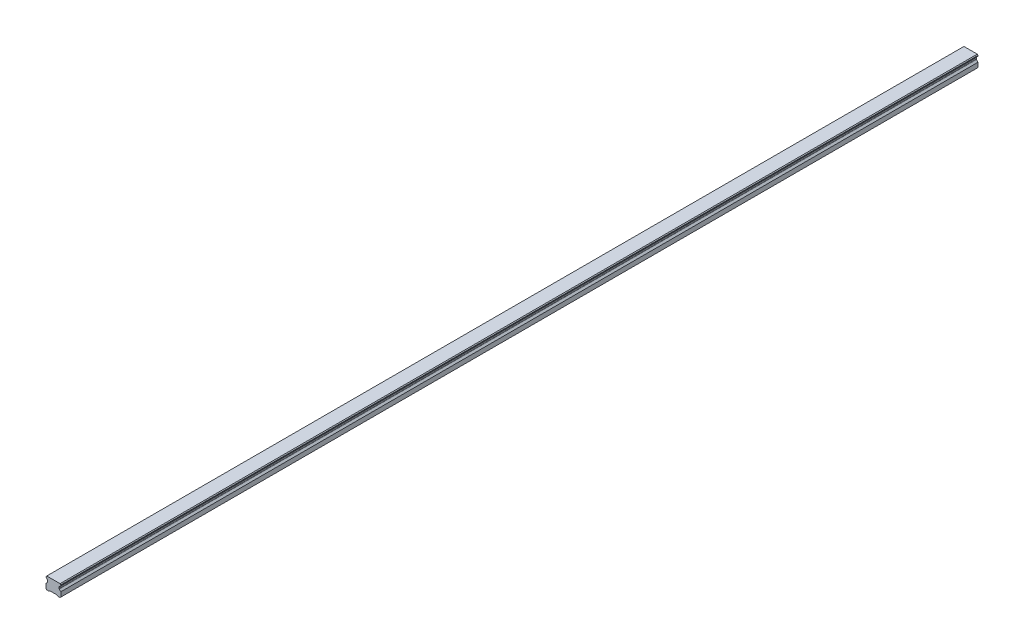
from build123d import *

# Parameters (mm, degrees)
SKETCH1_W           = 20
SKETCH1_H           = 16.3
BOSS_EXTRUDE1_DEPTH = 620
CUT_EXTRUDE1_DEPTH  = 1241.147446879
CHAMFER1_SIZE       = 1
FILLET1_R           = 1
CUT_EXTRUDE2_DEPTH  = 1241.147446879
SKETCH5_R           = 3
SKETCH5_R_2         = 2.5
CUT_EXTRUDE5_DEPTH  = 10
SKETCH5_2_R         = 2.5
CUT_EXTRUDE6_DEPTH  = 13
LPATTERN2_COUNT     = 21
LPATTERN2_PITCH     = 60


with BuildPart() as part:
    # Sketch1 → Boss-Extrude1 (new, symmetric)
    with BuildSketch(Plane.XY):
        with Locations((0, 8.15)):
            Rectangle(SKETCH1_W, SKETCH1_H)
    extrude(amount=BOSS_EXTRUDE1_DEPTH, both=True)

    # Sketch2 → Cut-Extrude1 (cut, through all)
    with BuildSketch(Plane.XY.offset(620)):
        Polygon((-10, 14.3), (-10, 7.3), (-7.666666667, 9.633333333), (-7.666666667, 11.966666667), align=None)
        Polygon((7.666666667, 11.966666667), (10, 14.3), (10, 7.3), (7.666666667, 9.633333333), align=None)
    extrude(amount=-CUT_EXTRUDE1_DEPTH, mode=Mode.SUBTRACT)

    # Chamfer1
    chamfer1_edges = [part.edges().sort_by_distance(p)[0] for p in [
        (-10, 16.3, 0),
        (10, 16.3, 0),
        (10, 0, 0),
        (-10, 0, 0),
    ]]
    chamfer(chamfer1_edges, length=CHAMFER1_SIZE)

    # Fillet1
    fillet1_edges = [part.edges().sort_by_distance(p)[0] for p in [
        (-7.666666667, 11.966666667, 0),
        (-7.666666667, 9.633333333, 0),
        (7.666666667, 9.633333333, 0),
        (7.666666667, 11.966666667, 0),
    ]]
    fillet(fillet1_edges, radius=FILLET1_R)

    # Sketch3 → Cut-Extrude2 (cut, through all)
    with BuildSketch(Plane.XY.offset(620)):
        Polygon((-6, 0), (-5, 1), (5, 1), (6, 0), align=None)
    extrude(amount=-CUT_EXTRUDE2_DEPTH, mode=Mode.SUBTRACT)

    # Sketch5 → Cut-Extrude5 (cut)
    with BuildSketch(Plane.XZ.offset(-1)):
        with Locations(Location((0, 600, 0), (0, 0, 270))):
            Circle(SKETCH5_R)
        with Locations(Location((0, 600, 0), (0, 0, 270))):
            Circle(SKETCH5_R_2, mode=Mode.SUBTRACT)
    cut_extrude5 = extrude(amount=-CUT_EXTRUDE5_DEPTH, mode=Mode.SUBTRACT)

    # Sketch5_2 → Cut-Extrude6 (cut)
    with BuildSketch(Plane.XZ.offset(-1)):
        with Locations(Location((0, 600, 0), (0, 0, 270))):
            Circle(SKETCH5_2_R)
    cut_extrude6 = extrude(amount=-CUT_EXTRUDE6_DEPTH, mode=Mode.SUBTRACT)

    # Cut-Extrude7 cone 1 section (on through the dimple's axis) → Cut-Extrude7 (revolve, cut)
    with BuildSketch(Plane(origin=(0, 14, 600), x_dir=(0, 0, -1), z_dir=(1, 0, 0))):
        Polygon((0, 0), (2.5, 0), (0, 1.443375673), align=None)
    cut_extrude7 = revolve(axis=Axis((0, 14, 600), (0, 1, 0)), mode=Mode.SUBTRACT)

    # LPattern2: Cut-Extrude5, Cut-Extrude6, Cut-Extrude7 ×21
    with Locations(*[(0, 0, -i * LPATTERN2_PITCH) for i in range(1, LPATTERN2_COUNT)]):
        add(cut_extrude5, mode=Mode.SUBTRACT)
        add(cut_extrude6, mode=Mode.SUBTRACT)
        add(cut_extrude7, mode=Mode.SUBTRACT)


solid = part.part
